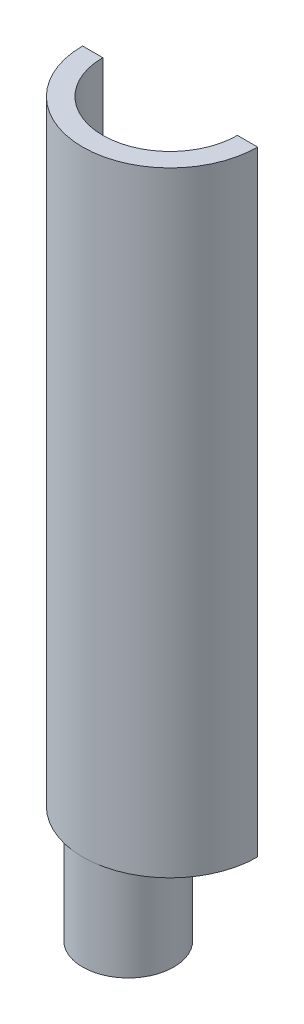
ISO-10303-21;
HEADER;
FILE_DESCRIPTION(('STEP AP214'),'2;1');
FILE_NAME('part.step','',(''),(''),'','','');
FILE_SCHEMA(('AUTOMOTIVE_DESIGN { 1 0 10303 214 1 1 1 1 }'));
ENDSEC;
DATA;
#1=APPLICATION_CONTEXT('core data for automotive mechanical design processes');
#2=APPLICATION_PROTOCOL_DEFINITION('international standard','automotive_design',2000,#1);
#3=PRODUCT_CONTEXT('',#1,'mechanical');
#4=PRODUCT('Part','Part','',(#3));
#5=PRODUCT_RELATED_PRODUCT_CATEGORY('part','',(#4));
#6=PRODUCT_DEFINITION_FORMATION('','',#4);
#7=PRODUCT_DEFINITION_CONTEXT('part definition',#1,'design');
#8=PRODUCT_DEFINITION('design','',#6,#7);
#9=PRODUCT_DEFINITION_SHAPE('','',#8);
#10=(LENGTH_UNIT() NAMED_UNIT(*) SI_UNIT(.MILLI.,.METRE.));
#11=(NAMED_UNIT(*) PLANE_ANGLE_UNIT() SI_UNIT($,.RADIAN.));
#12=(NAMED_UNIT(*) SI_UNIT($,.STERADIAN.) SOLID_ANGLE_UNIT());
#13=UNCERTAINTY_MEASURE_WITH_UNIT(LENGTH_MEASURE(1.E-05),#10,'distance_accuracy_value','');
#14=(GEOMETRIC_REPRESENTATION_CONTEXT(3) GLOBAL_UNCERTAINTY_ASSIGNED_CONTEXT((#13)) GLOBAL_UNIT_ASSIGNED_CONTEXT((#10,
#11,#12)) REPRESENTATION_CONTEXT('',''));
#15=CARTESIAN_POINT('',(0.,0.,0.));
#16=DIRECTION('',(0.,0.,1.));
#17=DIRECTION('',(1.,0.,0.));
#18=AXIS2_PLACEMENT_3D('',#15,#16,#17);
#19=CARTESIAN_POINT('',(8.255,58.,0.));
#20=DIRECTION('',(0.,0.,1.));
#21=DIRECTION('',(1.,0.,0.));
#22=AXIS2_PLACEMENT_3D('',#19,#20,#21);
#23=PLANE('',#22);
#24=DIRECTION('',(-1.,0.,0.));
#25=VECTOR('',#24,1.);
#26=CARTESIAN_POINT('',(8.255,1.4,0.));
#27=LINE('',#26,#25);
#28=CARTESIAN_POINT('',(-0.831850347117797,1.4,0.));
#29=VERTEX_POINT('',#28);
#30=CARTESIAN_POINT('',(-6.35,1.4,0.));
#31=VERTEX_POINT('',#30);
#32=EDGE_CURVE('E185',#29,#31,#27,.T.);
#33=ORIENTED_EDGE('',*,*,#32,.F.);
#34=DIRECTION('',(0.,1.,0.));
#35=VECTOR('',#34,1.);
#36=CARTESIAN_POINT('',(-0.831850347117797,-9.,0.));
#37=LINE('',#36,#35);
#38=CARTESIAN_POINT('',(-0.831850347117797,-9.,0.));
#39=VERTEX_POINT('',#38);
#40=EDGE_CURVE('E147',#39,#29,#37,.T.);
#41=ORIENTED_EDGE('',*,*,#40,.F.);
#42=DIRECTION('',(-1.,0.,0.));
#43=VECTOR('',#42,1.);
#44=CARTESIAN_POINT('',(0.,-9.,0.));
#45=LINE('',#44,#43);
#46=CARTESIAN_POINT('',(-1.6875944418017,-9.,0.));
#47=VERTEX_POINT('',#46);
#48=EDGE_CURVE('E168',#39,#47,#45,.T.);
#49=ORIENTED_EDGE('',*,*,#48,.T.);
#50=DIRECTION('',(0.,1.,0.));
#51=VECTOR('',#50,1.);
#52=CARTESIAN_POINT('',(-1.6875944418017,-9.,0.));
#53=LINE('',#52,#51);
#54=CARTESIAN_POINT('',(-1.6875944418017,0.,0.));
#55=VERTEX_POINT('',#54);
#56=EDGE_CURVE('E172',#47,#55,#53,.T.);
#57=ORIENTED_EDGE('',*,*,#56,.T.);
#58=DIRECTION('',(-1.,0.,0.));
#59=VECTOR('',#58,1.);
#60=CARTESIAN_POINT('',(8.255,0.,0.));
#61=LINE('',#60,#59);
#62=CARTESIAN_POINT('',(-8.255,0.,0.));
#63=VERTEX_POINT('',#62);
#64=EDGE_CURVE('E215',#55,#63,#61,.T.);
#65=ORIENTED_EDGE('',*,*,#64,.T.);
#66=DIRECTION('',(0.,-1.,0.));
#67=VECTOR('',#66,1.);
#68=CARTESIAN_POINT('',(-8.255,58.,0.));
#69=LINE('',#68,#67);
#70=CARTESIAN_POINT('',(-8.255,58.,0.));
#71=VERTEX_POINT('',#70);
#72=EDGE_CURVE('E224',#71,#63,#69,.T.);
#73=ORIENTED_EDGE('',*,*,#72,.F.);
#74=DIRECTION('',(-1.,0.,0.));
#75=VECTOR('',#74,1.);
#76=CARTESIAN_POINT('',(-6.35,58.,0.));
#77=LINE('',#76,#75);
#78=CARTESIAN_POINT('',(-6.35,58.,0.));
#79=VERTEX_POINT('',#78);
#80=EDGE_CURVE('E200',#79,#71,#77,.T.);
#81=ORIENTED_EDGE('',*,*,#80,.F.);
#82=DIRECTION('',(0.,-1.,0.));
#83=VECTOR('',#82,1.);
#84=CARTESIAN_POINT('',(-6.35,58.,0.));
#85=LINE('',#84,#83);
#86=EDGE_CURVE('E228',#79,#31,#85,.T.);
#87=ORIENTED_EDGE('',*,*,#86,.T.);
#88=EDGE_LOOP('',(#33,#41,#49,#57,#65,#73,#81,#87));
#89=FACE_BOUND('',#88,.T.);
#90=ADVANCED_FACE('F45',(#89),#23,.F.);
#91=CARTESIAN_POINT('',(0.,0.,0.));
#92=DIRECTION('',(0.,1.,0.));
#93=DIRECTION('',(0.,0.,1.));
#94=AXIS2_PLACEMENT_3D('',#91,#92,#93);
#95=PLANE('',#94);
#96=ORIENTED_EDGE('',*,*,#64,.F.);
#97=CARTESIAN_POINT('',(0.,0.,3.955));
#98=DIRECTION('',(0.,1.,0.));
#99=DIRECTION('',(0.,0.,1.));
#100=AXIS2_PLACEMENT_3D('',#97,#98,#99);
#101=CIRCLE('',#100,4.3);
#102=CARTESIAN_POINT('',(0.,0.,8.255));
#103=VERTEX_POINT('',#102);
#104=EDGE_CURVE('E174',#55,#103,#101,.T.);
#105=ORIENTED_EDGE('',*,*,#104,.T.);
#106=CARTESIAN_POINT('',(0.,0.,0.));
#107=DIRECTION('',(0.,1.,0.));
#108=DIRECTION('',(0.,0.,1.));
#109=AXIS2_PLACEMENT_3D('',#106,#107,#108);
#110=CIRCLE('',#109,8.255);
#111=EDGE_CURVE('E211',#63,#103,#110,.T.);
#112=ORIENTED_EDGE('',*,*,#111,.F.);
#113=EDGE_LOOP('',(#96,#105,#112));
#114=FACE_BOUND('',#113,.T.);
#115=ADVANCED_FACE('F311',(#114),#95,.F.);
#116=CARTESIAN_POINT('',(0.,58.,0.));
#117=DIRECTION('',(0.,-1.,0.));
#118=DIRECTION('',(0.,0.,-1.));
#119=AXIS2_PLACEMENT_3D('',#116,#117,#118);
#120=CYLINDRICAL_SURFACE('',#119,6.35);
#121=DIRECTION('',(0.,-1.,0.));
#122=VECTOR('',#121,1.);
#123=CARTESIAN_POINT('',(6.35,58.,0.));
#124=LINE('',#123,#122);
#125=CARTESIAN_POINT('',(6.35,58.,0.));
#126=VERTEX_POINT('',#125);
#127=CARTESIAN_POINT('',(6.35,1.4,0.));
#128=VERTEX_POINT('',#127);
#129=EDGE_CURVE('E210',#126,#128,#124,.T.);
#130=ORIENTED_EDGE('',*,*,#129,.T.);
#131=CARTESIAN_POINT('',(0.,1.4,0.));
#132=DIRECTION('',(0.,1.,0.));
#133=DIRECTION('',(0.,0.,1.));
#134=AXIS2_PLACEMENT_3D('',#131,#132,#133);
#135=CIRCLE('',#134,6.35);
#136=EDGE_CURVE('E191',#128,#31,#135,.F.);
#137=ORIENTED_EDGE('',*,*,#136,.T.);
#138=ORIENTED_EDGE('',*,*,#86,.F.);
#139=CARTESIAN_POINT('',(0.,58.,0.));
#140=DIRECTION('',(0.,-1.,0.));
#141=DIRECTION('',(0.,0.,1.));
#142=AXIS2_PLACEMENT_3D('',#139,#140,#141);
#143=CIRCLE('',#142,6.35);
#144=EDGE_CURVE('E196',#126,#79,#143,.T.);
#145=ORIENTED_EDGE('',*,*,#144,.F.);
#146=EDGE_LOOP('',(#130,#137,#138,#145));
#147=FACE_BOUND('',#146,.T.);
#148=ADVANCED_FACE('F47',(#147),#120,.F.);
#149=CARTESIAN_POINT('',(0.,58.,0.));
#150=DIRECTION('',(0.,-1.,0.));
#151=DIRECTION('',(0.,0.,-1.));
#152=AXIS2_PLACEMENT_3D('',#149,#150,#151);
#153=CYLINDRICAL_SURFACE('',#152,8.255);
#154=ORIENTED_EDGE('',*,*,#72,.T.);
#155=ORIENTED_EDGE('',*,*,#111,.T.);
#156=CARTESIAN_POINT('',(8.255,0.,0.));
#157=VERTEX_POINT('',#156);
#158=EDGE_CURVE('E195',#103,#157,#110,.T.);
#159=ORIENTED_EDGE('',*,*,#158,.T.);
#160=DIRECTION('',(0.,-1.,0.));
#161=VECTOR('',#160,1.);
#162=CARTESIAN_POINT('',(8.255,58.,0.));
#163=LINE('',#162,#161);
#164=CARTESIAN_POINT('',(8.255,58.,0.));
#165=VERTEX_POINT('',#164);
#166=EDGE_CURVE('E220',#165,#157,#163,.T.);
#167=ORIENTED_EDGE('',*,*,#166,.F.);
#168=CARTESIAN_POINT('',(0.,58.,0.));
#169=DIRECTION('',(0.,1.,0.));
#170=DIRECTION('',(0.,0.,1.));
#171=AXIS2_PLACEMENT_3D('',#168,#169,#170);
#172=CIRCLE('',#171,8.255);
#173=EDGE_CURVE('E204',#71,#165,#172,.T.);
#174=ORIENTED_EDGE('',*,*,#173,.F.);
#175=EDGE_LOOP('',(#154,#155,#159,#167,#174));
#176=FACE_BOUND('',#175,.T.);
#177=ADVANCED_FACE('F255',(#176),#153,.T.);
#178=CARTESIAN_POINT('',(1.6875944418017,-9.,0.));
#179=VERTEX_POINT('',#178);
#180=CARTESIAN_POINT('',(0.831850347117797,-9.,0.));
#181=VERTEX_POINT('',#180);
#182=EDGE_CURVE('E155',#179,#181,#45,.T.);
#183=ORIENTED_EDGE('',*,*,#182,.T.);
#184=DIRECTION('',(0.,1.,0.));
#185=VECTOR('',#184,1.);
#186=CARTESIAN_POINT('',(0.831850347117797,-9.,0.));
#187=LINE('',#186,#185);
#188=CARTESIAN_POINT('',(0.831850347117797,1.4,0.));
#189=VERTEX_POINT('',#188);
#190=EDGE_CURVE('E135',#181,#189,#187,.T.);
#191=ORIENTED_EDGE('',*,*,#190,.T.);
#192=EDGE_CURVE('E188',#128,#189,#27,.T.);
#193=ORIENTED_EDGE('',*,*,#192,.F.);
#194=ORIENTED_EDGE('',*,*,#129,.F.);
#195=DIRECTION('',(-1.,0.,0.));
#196=VECTOR('',#195,1.);
#197=CARTESIAN_POINT('',(8.255,58.,0.));
#198=LINE('',#197,#196);
#199=EDGE_CURVE('E207',#165,#126,#198,.T.);
#200=ORIENTED_EDGE('',*,*,#199,.F.);
#201=ORIENTED_EDGE('',*,*,#166,.T.);
#202=CARTESIAN_POINT('',(1.6875944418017,0.,0.));
#203=VERTEX_POINT('',#202);
#204=EDGE_CURVE('E201',#157,#203,#61,.T.);
#205=ORIENTED_EDGE('',*,*,#204,.T.);
#206=DIRECTION('',(0.,1.,0.));
#207=VECTOR('',#206,1.);
#208=CARTESIAN_POINT('',(1.6875944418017,-9.,0.));
#209=LINE('',#208,#207);
#210=EDGE_CURVE('E164',#179,#203,#209,.T.);
#211=ORIENTED_EDGE('',*,*,#210,.F.);
#212=EDGE_LOOP('',(#183,#191,#193,#194,#200,#201,#205,#211));
#213=FACE_BOUND('',#212,.T.);
#214=ADVANCED_FACE('F162',(#213),#23,.F.);
#215=CARTESIAN_POINT('',(0.,58.,0.));
#216=DIRECTION('',(0.,1.,0.));
#217=DIRECTION('',(0.,0.,1.));
#218=AXIS2_PLACEMENT_3D('',#215,#216,#217);
#219=PLANE('',#218);
#220=ORIENTED_EDGE('',*,*,#144,.T.);
#221=ORIENTED_EDGE('',*,*,#80,.T.);
#222=ORIENTED_EDGE('',*,*,#173,.T.);
#223=ORIENTED_EDGE('',*,*,#199,.T.);
#224=EDGE_LOOP('',(#220,#221,#222,#223));
#225=FACE_BOUND('',#224,.T.);
#226=ADVANCED_FACE('F271',(#225),#219,.T.);
#227=ORIENTED_EDGE('',*,*,#158,.F.);
#228=EDGE_CURVE('E182',#103,#203,#101,.T.);
#229=ORIENTED_EDGE('',*,*,#228,.T.);
#230=ORIENTED_EDGE('',*,*,#204,.F.);
#231=EDGE_LOOP('',(#227,#229,#230));
#232=FACE_BOUND('',#231,.T.);
#233=ADVANCED_FACE('F247',(#232),#95,.F.);
#234=CARTESIAN_POINT('',(0.,1.4,0.));
#235=DIRECTION('',(0.,1.,0.));
#236=DIRECTION('',(0.,0.,1.));
#237=AXIS2_PLACEMENT_3D('',#234,#235,#236);
#238=PLANE('',#237);
#239=DIRECTION('',(0.,0.,1.));
#240=VECTOR('',#239,1.);
#241=CARTESIAN_POINT('',(-0.831850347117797,1.4,0.));
#242=LINE('',#241,#240);
#243=CARTESIAN_POINT('',(-0.831850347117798,1.4,3.4));
#244=VERTEX_POINT('',#243);
#245=EDGE_CURVE('E68',#29,#244,#242,.T.);
#246=ORIENTED_EDGE('',*,*,#245,.F.);
#247=ORIENTED_EDGE('',*,*,#32,.T.);
#248=ORIENTED_EDGE('',*,*,#136,.F.);
#249=ORIENTED_EDGE('',*,*,#192,.T.);
#250=DIRECTION('',(0.,0.,-1.));
#251=VECTOR('',#250,1.);
#252=CARTESIAN_POINT('',(0.831850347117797,1.4,0.));
#253=LINE('',#252,#251);
#254=CARTESIAN_POINT('',(0.831850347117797,1.4,3.4));
#255=VERTEX_POINT('',#254);
#256=EDGE_CURVE('E141',#255,#189,#253,.T.);
#257=ORIENTED_EDGE('',*,*,#256,.F.);
#258=CARTESIAN_POINT('',(0.,1.4,3.955));
#259=DIRECTION('',(0.,1.,0.));
#260=DIRECTION('',(0.,0.,1.));
#261=AXIS2_PLACEMENT_3D('',#258,#259,#260);
#262=CIRCLE('',#261,1.);
#263=EDGE_CURVE('E232',#255,#244,#262,.F.);
#264=ORIENTED_EDGE('',*,*,#263,.T.);
#265=EDGE_LOOP('',(#246,#247,#248,#249,#257,#264));
#266=FACE_BOUND('',#265,.T.);
#267=ADVANCED_FACE('F263',(#266),#238,.T.);
#268=CARTESIAN_POINT('',(0.,-9.,3.955));
#269=DIRECTION('',(0.,1.,0.));
#270=DIRECTION('',(0.,0.,1.));
#271=AXIS2_PLACEMENT_3D('',#268,#269,#270);
#272=CYLINDRICAL_SURFACE('',#271,4.3);
#273=ORIENTED_EDGE('',*,*,#104,.F.);
#274=ORIENTED_EDGE('',*,*,#56,.F.);
#275=CARTESIAN_POINT('',(0.,-9.,3.955));
#276=DIRECTION('',(0.,1.,0.));
#277=DIRECTION('',(0.,0.,1.));
#278=AXIS2_PLACEMENT_3D('',#275,#276,#277);
#279=CIRCLE('',#278,4.3);
#280=EDGE_CURVE('E167',#47,#179,#279,.T.);
#281=ORIENTED_EDGE('',*,*,#280,.T.);
#282=ORIENTED_EDGE('',*,*,#210,.T.);
#283=ORIENTED_EDGE('',*,*,#228,.F.);
#284=EDGE_LOOP('',(#273,#274,#281,#282,#283));
#285=FACE_BOUND('',#284,.T.);
#286=ADVANCED_FACE('F312',(#285),#272,.T.);
#287=CARTESIAN_POINT('',(0.,-9.,3.955));
#288=DIRECTION('',(0.,1.,0.));
#289=DIRECTION('',(0.,0.,1.));
#290=AXIS2_PLACEMENT_3D('',#287,#288,#289);
#291=PLANE('',#290);
#292=ORIENTED_EDGE('',*,*,#48,.F.);
#293=DIRECTION('',(0.,0.,1.));
#294=VECTOR('',#293,1.);
#295=CARTESIAN_POINT('',(-0.831850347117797,-9.,3.4));
#296=LINE('',#295,#294);
#297=CARTESIAN_POINT('',(-0.831850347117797,-9.,1.07263551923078));
#298=VERTEX_POINT('',#297);
#299=EDGE_CURVE('E148',#39,#298,#296,.T.);
#300=ORIENTED_EDGE('',*,*,#299,.T.);
#301=CARTESIAN_POINT('',(0.,-9.,3.955));
#302=DIRECTION('',(0.,1.,0.));
#303=DIRECTION('',(0.,0.,1.));
#304=AXIS2_PLACEMENT_3D('',#301,#302,#303);
#305=CIRCLE('',#304,3.);
#306=CARTESIAN_POINT('',(0.831850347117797,-9.,1.07263551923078));
#307=VERTEX_POINT('',#306);
#308=EDGE_CURVE('E159',#298,#307,#305,.T.);
#309=ORIENTED_EDGE('',*,*,#308,.T.);
#310=DIRECTION('',(0.,0.,-1.));
#311=VECTOR('',#310,1.);
#312=CARTESIAN_POINT('',(0.831850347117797,-9.,3.4));
#313=LINE('',#312,#311);
#314=EDGE_CURVE('E138',#307,#181,#313,.T.);
#315=ORIENTED_EDGE('',*,*,#314,.T.);
#316=ORIENTED_EDGE('',*,*,#182,.F.);
#317=ORIENTED_EDGE('',*,*,#280,.F.);
#318=EDGE_LOOP('',(#292,#300,#309,#315,#316,#317));
#319=FACE_BOUND('',#318,.T.);
#320=ADVANCED_FACE('F153',(#319),#291,.F.);
#321=CARTESIAN_POINT('',(0.,-9.,3.955));
#322=DIRECTION('',(0.,1.,0.));
#323=DIRECTION('',(0.,0.,1.));
#324=AXIS2_PLACEMENT_3D('',#321,#322,#323);
#325=CYLINDRICAL_SURFACE('',#324,3.);
#326=ORIENTED_EDGE('',*,*,#308,.F.);
#327=DIRECTION('',(0.,1.,0.));
#328=VECTOR('',#327,1.);
#329=CARTESIAN_POINT('',(-0.831850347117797,-9.,1.07263551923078));
#330=LINE('',#329,#328);
#331=CARTESIAN_POINT('',(-0.831850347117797,0.,1.07263551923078));
#332=VERTEX_POINT('',#331);
#333=EDGE_CURVE('E286',#298,#332,#330,.T.);
#334=ORIENTED_EDGE('',*,*,#333,.T.);
#335=CARTESIAN_POINT('',(0.,0.,3.955));
#336=DIRECTION('',(0.,1.,0.));
#337=DIRECTION('',(0.,0.,1.));
#338=AXIS2_PLACEMENT_3D('',#335,#336,#337);
#339=CIRCLE('',#338,3.);
#340=CARTESIAN_POINT('',(0.831850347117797,0.,1.07263551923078));
#341=VERTEX_POINT('',#340);
#342=EDGE_CURVE('E176',#332,#341,#339,.T.);
#343=ORIENTED_EDGE('',*,*,#342,.T.);
#344=DIRECTION('',(0.,1.,0.));
#345=VECTOR('',#344,1.);
#346=CARTESIAN_POINT('',(0.831850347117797,-9.,1.07263551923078));
#347=LINE('',#346,#345);
#348=EDGE_CURVE('E275',#341,#307,#347,.F.);
#349=ORIENTED_EDGE('',*,*,#348,.T.);
#350=EDGE_LOOP('',(#326,#334,#343,#349));
#351=FACE_BOUND('',#350,.T.);
#352=ADVANCED_FACE('F303',(#351),#325,.F.);
#353=ORIENTED_EDGE('',*,*,#342,.F.);
#354=DIRECTION('',(0.,0.,1.));
#355=VECTOR('',#354,1.);
#356=CARTESIAN_POINT('',(-0.831850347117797,0.,0.));
#357=LINE('',#356,#355);
#358=CARTESIAN_POINT('',(-0.831850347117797,0.,3.4));
#359=VERTEX_POINT('',#358);
#360=EDGE_CURVE('E274',#332,#359,#357,.T.);
#361=ORIENTED_EDGE('',*,*,#360,.T.);
#362=CARTESIAN_POINT('',(0.,0.,3.955));
#363=DIRECTION('',(0.,1.,0.));
#364=DIRECTION('',(0.,0.,1.));
#365=AXIS2_PLACEMENT_3D('',#362,#363,#364);
#366=CIRCLE('',#365,1.);
#367=CARTESIAN_POINT('',(0.831850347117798,0.,3.4));
#368=VERTEX_POINT('',#367);
#369=EDGE_CURVE('E235',#359,#368,#366,.T.);
#370=ORIENTED_EDGE('',*,*,#369,.T.);
#371=DIRECTION('',(0.,0.,-1.));
#372=VECTOR('',#371,1.);
#373=CARTESIAN_POINT('',(0.831850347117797,0.,0.));
#374=LINE('',#373,#372);
#375=EDGE_CURVE('E61',#368,#341,#374,.T.);
#376=ORIENTED_EDGE('',*,*,#375,.T.);
#377=EDGE_LOOP('',(#353,#361,#370,#376));
#378=FACE_BOUND('',#377,.T.);
#379=ADVANCED_FACE('F284',(#378),#95,.F.);
#380=CARTESIAN_POINT('',(0.,9.,3.955));
#381=DIRECTION('',(0.,-1.,0.));
#382=DIRECTION('',(0.,0.,-1.));
#383=AXIS2_PLACEMENT_3D('',#380,#381,#382);
#384=CYLINDRICAL_SURFACE('',#383,1.);
#385=DIRECTION('',(0.,-1.,0.));
#386=VECTOR('',#385,1.);
#387=CARTESIAN_POINT('',(-0.831850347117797,9.,3.4));
#388=LINE('',#387,#386);
#389=EDGE_CURVE('E11',#244,#359,#388,.T.);
#390=ORIENTED_EDGE('',*,*,#389,.F.);
#391=ORIENTED_EDGE('',*,*,#263,.F.);
#392=DIRECTION('',(0.,-1.,0.));
#393=VECTOR('',#392,1.);
#394=CARTESIAN_POINT('',(0.831850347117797,9.,3.4));
#395=LINE('',#394,#393);
#396=EDGE_CURVE('E54',#368,#255,#395,.F.);
#397=ORIENTED_EDGE('',*,*,#396,.F.);
#398=ORIENTED_EDGE('',*,*,#369,.F.);
#399=EDGE_LOOP('',(#390,#391,#397,#398));
#400=FACE_BOUND('',#399,.T.);
#401=ADVANCED_FACE('F278',(#400),#384,.F.);
#402=CARTESIAN_POINT('',(0.831850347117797,-9.,3.4));
#403=DIRECTION('',(1.,0.,0.));
#404=DIRECTION('',(0.,0.,-1.));
#405=AXIS2_PLACEMENT_3D('',#402,#403,#404);
#406=PLANE('',#405);
#407=ORIENTED_EDGE('',*,*,#256,.T.);
#408=ORIENTED_EDGE('',*,*,#190,.F.);
#409=ORIENTED_EDGE('',*,*,#314,.F.);
#410=ORIENTED_EDGE('',*,*,#348,.F.);
#411=ORIENTED_EDGE('',*,*,#375,.F.);
#412=ORIENTED_EDGE('',*,*,#396,.T.);
#413=EDGE_LOOP('',(#407,#408,#409,#410,#411,#412));
#414=FACE_BOUND('',#413,.T.);
#415=ADVANCED_FACE('F137',(#414),#406,.F.);
#416=CARTESIAN_POINT('',(-0.831850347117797,-9.,3.4));
#417=DIRECTION('',(-1.,0.,0.));
#418=DIRECTION('',(0.,0.,1.));
#419=AXIS2_PLACEMENT_3D('',#416,#417,#418);
#420=PLANE('',#419);
#421=ORIENTED_EDGE('',*,*,#245,.T.);
#422=ORIENTED_EDGE('',*,*,#389,.T.);
#423=ORIENTED_EDGE('',*,*,#360,.F.);
#424=ORIENTED_EDGE('',*,*,#333,.F.);
#425=ORIENTED_EDGE('',*,*,#299,.F.);
#426=ORIENTED_EDGE('',*,*,#40,.T.);
#427=EDGE_LOOP('',(#421,#422,#423,#424,#425,#426));
#428=FACE_BOUND('',#427,.T.);
#429=ADVANCED_FACE('F282',(#428),#420,.F.);
#430=CLOSED_SHELL('',(#90,#115,#148,#177,#214,#226,#233,#267,#286,#320,#352,#379,#401,#415,#429));
#431=MANIFOLD_SOLID_BREP('B2',#430);
#432=ADVANCED_BREP_SHAPE_REPRESENTATION('',(#18,#431),#14);
#433=SHAPE_DEFINITION_REPRESENTATION(#9,#432);
ENDSEC;
END-ISO-10303-21;
